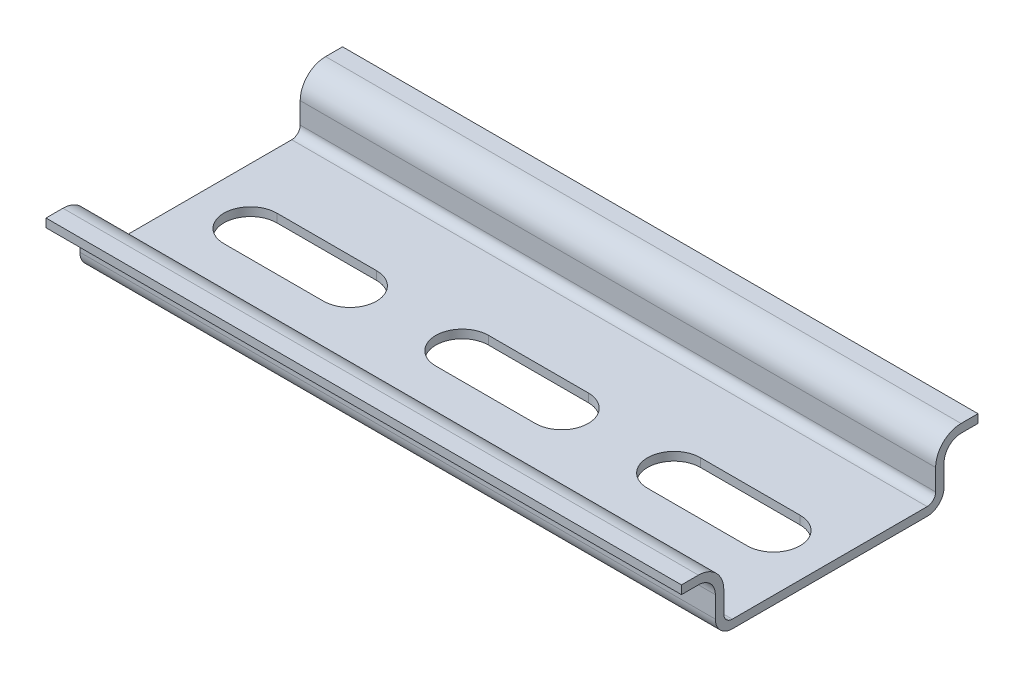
ISO-10303-21;
HEADER;
FILE_DESCRIPTION(('STEP AP214'),'2;1');
FILE_NAME('part.step','',(''),(''),'','','');
FILE_SCHEMA(('AUTOMOTIVE_DESIGN { 1 0 10303 214 1 1 1 1 }'));
ENDSEC;
DATA;
#1=APPLICATION_CONTEXT('core data for automotive mechanical design processes');
#2=APPLICATION_PROTOCOL_DEFINITION('international standard','automotive_design',2000,#1);
#3=PRODUCT_CONTEXT('',#1,'mechanical');
#4=PRODUCT('Part','Part','',(#3));
#5=PRODUCT_RELATED_PRODUCT_CATEGORY('part','',(#4));
#6=PRODUCT_DEFINITION_FORMATION('','',#4);
#7=PRODUCT_DEFINITION_CONTEXT('part definition',#1,'design');
#8=PRODUCT_DEFINITION('design','',#6,#7);
#9=PRODUCT_DEFINITION_SHAPE('','',#8);
#10=(LENGTH_UNIT() NAMED_UNIT(*) SI_UNIT(.MILLI.,.METRE.));
#11=(NAMED_UNIT(*) PLANE_ANGLE_UNIT() SI_UNIT($,.RADIAN.));
#12=(NAMED_UNIT(*) SI_UNIT($,.STERADIAN.) SOLID_ANGLE_UNIT());
#13=UNCERTAINTY_MEASURE_WITH_UNIT(LENGTH_MEASURE(1.E-05),#10,'distance_accuracy_value','');
#14=(GEOMETRIC_REPRESENTATION_CONTEXT(3) GLOBAL_UNCERTAINTY_ASSIGNED_CONTEXT((#13)) GLOBAL_UNIT_ASSIGNED_CONTEXT((#10,
#11,#12)) REPRESENTATION_CONTEXT('',''));
#15=CARTESIAN_POINT('',(0.,0.,0.));
#16=DIRECTION('',(0.,0.,1.));
#17=DIRECTION('',(1.,0.,0.));
#18=AXIS2_PLACEMENT_3D('',#15,#16,#17);
#19=CARTESIAN_POINT('',(-37.5,7.5,15.5));
#20=DIRECTION('',(0.,1.,0.));
#21=DIRECTION('',(0.,0.,1.));
#22=AXIS2_PLACEMENT_3D('',#19,#20,#21);
#23=PLANE('',#22);
#24=DIRECTION('',(1.,0.,0.));
#25=VECTOR('',#24,1.);
#26=CARTESIAN_POINT('',(-37.5,7.5,17.5));
#27=LINE('',#26,#25);
#28=CARTESIAN_POINT('',(-37.5,7.5,17.5));
#29=VERTEX_POINT('',#28);
#30=CARTESIAN_POINT('',(37.5,7.5,17.5));
#31=VERTEX_POINT('',#30);
#32=EDGE_CURVE('E34',#29,#31,#27,.T.);
#33=ORIENTED_EDGE('',*,*,#32,.T.);
#34=DIRECTION('',(0.,0.,-1.));
#35=VECTOR('',#34,1.);
#36=CARTESIAN_POINT('',(37.5,7.5,15.5));
#37=LINE('',#36,#35);
#38=CARTESIAN_POINT('',(37.5,7.5,15.5));
#39=VERTEX_POINT('',#38);
#40=EDGE_CURVE('E338',#39,#31,#37,.F.);
#41=ORIENTED_EDGE('',*,*,#40,.F.);
#42=DIRECTION('',(1.,0.,0.));
#43=VECTOR('',#42,1.);
#44=CARTESIAN_POINT('',(-37.5,7.5,15.5));
#45=LINE('',#44,#43);
#46=CARTESIAN_POINT('',(-37.5,7.5,15.5));
#47=VERTEX_POINT('',#46);
#48=EDGE_CURVE('E11',#47,#39,#45,.T.);
#49=ORIENTED_EDGE('',*,*,#48,.F.);
#50=DIRECTION('',(0.,0.,-1.));
#51=VECTOR('',#50,1.);
#52=CARTESIAN_POINT('',(-37.5,7.5,15.5));
#53=LINE('',#52,#51);
#54=EDGE_CURVE('E398',#47,#29,#53,.F.);
#55=ORIENTED_EDGE('',*,*,#54,.T.);
#56=EDGE_LOOP('',(#33,#41,#49,#55));
#57=FACE_BOUND('',#56,.T.);
#58=ADVANCED_FACE('F31',(#57),#23,.T.);
#59=CARTESIAN_POINT('',(-37.5,4.5,15.5));
#60=DIRECTION('',(1.,0.,0.));
#61=DIRECTION('',(0.,0.,-1.));
#62=AXIS2_PLACEMENT_3D('',#59,#60,#61);
#63=CYLINDRICAL_SURFACE('',#62,3.);
#64=ORIENTED_EDGE('',*,*,#48,.T.);
#65=CARTESIAN_POINT('',(37.5,4.5,15.5));
#66=DIRECTION('',(1.,0.,0.));
#67=DIRECTION('',(0.,0.,-1.));
#68=AXIS2_PLACEMENT_3D('',#65,#66,#67);
#69=CIRCLE('',#68,3.);
#70=CARTESIAN_POINT('',(37.5,4.5,12.5));
#71=VERTEX_POINT('',#70);
#72=EDGE_CURVE('E395',#71,#39,#69,.T.);
#73=ORIENTED_EDGE('',*,*,#72,.F.);
#74=DIRECTION('',(1.,0.,0.));
#75=VECTOR('',#74,1.);
#76=CARTESIAN_POINT('',(-37.5,4.5,12.5));
#77=LINE('',#76,#75);
#78=CARTESIAN_POINT('',(-37.5,4.5,12.5));
#79=VERTEX_POINT('',#78);
#80=EDGE_CURVE('E39',#79,#71,#77,.T.);
#81=ORIENTED_EDGE('',*,*,#80,.F.);
#82=CARTESIAN_POINT('',(-37.5,4.5,15.5));
#83=DIRECTION('',(1.,0.,0.));
#84=DIRECTION('',(0.,0.,-1.));
#85=AXIS2_PLACEMENT_3D('',#82,#83,#84);
#86=CIRCLE('',#85,3.);
#87=EDGE_CURVE('E444',#79,#47,#86,.T.);
#88=ORIENTED_EDGE('',*,*,#87,.T.);
#89=EDGE_LOOP('',(#64,#73,#81,#88));
#90=FACE_BOUND('',#89,.T.);
#91=ADVANCED_FACE('F506',(#90),#63,.T.);
#92=CARTESIAN_POINT('',(-37.5,2.,12.5));
#93=DIRECTION('',(0.,0.,-1.));
#94=DIRECTION('',(-1.,0.,0.));
#95=AXIS2_PLACEMENT_3D('',#92,#93,#94);
#96=PLANE('',#95);
#97=ORIENTED_EDGE('',*,*,#80,.T.);
#98=DIRECTION('',(0.,1.,0.));
#99=VECTOR('',#98,1.);
#100=CARTESIAN_POINT('',(37.5,2.,12.5));
#101=LINE('',#100,#99);
#102=CARTESIAN_POINT('',(37.5,2.,12.5));
#103=VERTEX_POINT('',#102);
#104=EDGE_CURVE('E392',#103,#71,#101,.T.);
#105=ORIENTED_EDGE('',*,*,#104,.F.);
#106=DIRECTION('',(1.,0.,0.));
#107=VECTOR('',#106,1.);
#108=CARTESIAN_POINT('',(-37.5,2.,12.5));
#109=LINE('',#108,#107);
#110=CARTESIAN_POINT('',(-37.5,2.,12.5));
#111=VERTEX_POINT('',#110);
#112=EDGE_CURVE('E448',#111,#103,#109,.T.);
#113=ORIENTED_EDGE('',*,*,#112,.F.);
#114=DIRECTION('',(0.,1.,0.));
#115=VECTOR('',#114,1.);
#116=CARTESIAN_POINT('',(-37.5,2.,12.5));
#117=LINE('',#116,#115);
#118=EDGE_CURVE('E441',#111,#79,#117,.T.);
#119=ORIENTED_EDGE('',*,*,#118,.T.);
#120=EDGE_LOOP('',(#97,#105,#113,#119));
#121=FACE_BOUND('',#120,.T.);
#122=ADVANCED_FACE('F510',(#121),#96,.T.);
#123=CARTESIAN_POINT('',(-37.5,2.,11.5));
#124=DIRECTION('',(1.,0.,0.));
#125=DIRECTION('',(0.,0.,-1.));
#126=AXIS2_PLACEMENT_3D('',#123,#124,#125);
#127=CYLINDRICAL_SURFACE('',#126,0.999999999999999);
#128=ORIENTED_EDGE('',*,*,#112,.T.);
#129=CARTESIAN_POINT('',(37.5,2.,11.5));
#130=DIRECTION('',(1.,0.,0.));
#131=DIRECTION('',(0.,0.,-1.));
#132=AXIS2_PLACEMENT_3D('',#129,#130,#131);
#133=CIRCLE('',#132,0.999999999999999);
#134=CARTESIAN_POINT('',(37.5,1.,11.5));
#135=VERTEX_POINT('',#134);
#136=EDGE_CURVE('E389',#135,#103,#133,.F.);
#137=ORIENTED_EDGE('',*,*,#136,.F.);
#138=DIRECTION('',(1.,0.,0.));
#139=VECTOR('',#138,1.);
#140=CARTESIAN_POINT('',(-37.5,1.,11.5));
#141=LINE('',#140,#139);
#142=CARTESIAN_POINT('',(-37.5,1.,11.5));
#143=VERTEX_POINT('',#142);
#144=EDGE_CURVE('E450',#143,#135,#141,.T.);
#145=ORIENTED_EDGE('',*,*,#144,.F.);
#146=CARTESIAN_POINT('',(-37.5,2.,11.5));
#147=DIRECTION('',(1.,0.,0.));
#148=DIRECTION('',(0.,0.,-1.));
#149=AXIS2_PLACEMENT_3D('',#146,#147,#148);
#150=CIRCLE('',#149,0.999999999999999);
#151=EDGE_CURVE('E438',#143,#111,#150,.F.);
#152=ORIENTED_EDGE('',*,*,#151,.T.);
#153=EDGE_LOOP('',(#128,#137,#145,#152));
#154=FACE_BOUND('',#153,.T.);
#155=ADVANCED_FACE('F516',(#154),#127,.F.);
#156=CARTESIAN_POINT('',(-37.5,1.,11.5));
#157=DIRECTION('',(0.,1.,0.));
#158=DIRECTION('',(0.,0.,1.));
#159=AXIS2_PLACEMENT_3D('',#156,#157,#158);
#160=PLANE('',#159);
#161=CARTESIAN_POINT('',(30.875,0.999999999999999,0.));
#162=DIRECTION('',(0.,1.,0.));
#163=DIRECTION('',(0.,0.,1.));
#164=AXIS2_PLACEMENT_3D('',#161,#162,#163);
#165=CIRCLE('',#164,3.125);
#166=CARTESIAN_POINT('',(30.875,0.999999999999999,-3.125));
#167=VERTEX_POINT('',#166);
#168=CARTESIAN_POINT('',(30.875,0.999999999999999,3.125));
#169=VERTEX_POINT('',#168);
#170=EDGE_CURVE('E250',#167,#169,#165,.F.);
#171=ORIENTED_EDGE('',*,*,#170,.T.);
#172=DIRECTION('',(-1.,0.,0.));
#173=VECTOR('',#172,1.);
#174=CARTESIAN_POINT('',(19.125,0.999999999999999,3.125));
#175=LINE('',#174,#173);
#176=CARTESIAN_POINT('',(19.125,1.,3.125));
#177=VERTEX_POINT('',#176);
#178=EDGE_CURVE('E239',#169,#177,#175,.T.);
#179=ORIENTED_EDGE('',*,*,#178,.T.);
#180=CARTESIAN_POINT('',(19.125,0.999999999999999,0.));
#181=DIRECTION('',(0.,1.,0.));
#182=DIRECTION('',(0.,0.,1.));
#183=AXIS2_PLACEMENT_3D('',#180,#181,#182);
#184=CIRCLE('',#183,3.125);
#185=CARTESIAN_POINT('',(19.125,0.999999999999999,-3.125));
#186=VERTEX_POINT('',#185);
#187=EDGE_CURVE('E261',#177,#186,#184,.F.);
#188=ORIENTED_EDGE('',*,*,#187,.T.);
#189=DIRECTION('',(1.,0.,0.));
#190=VECTOR('',#189,1.);
#191=CARTESIAN_POINT('',(19.125,0.999999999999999,-3.125));
#192=LINE('',#191,#190);
#193=EDGE_CURVE('E257',#186,#167,#192,.T.);
#194=ORIENTED_EDGE('',*,*,#193,.T.);
#195=EDGE_LOOP('',(#171,#179,#188,#194));
#196=FACE_BOUND('',#195,.T.);
#197=CARTESIAN_POINT('',(-19.125,0.999999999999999,0.));
#198=DIRECTION('',(0.,1.,0.));
#199=DIRECTION('',(0.,0.,1.));
#200=AXIS2_PLACEMENT_3D('',#197,#198,#199);
#201=CIRCLE('',#200,3.125);
#202=CARTESIAN_POINT('',(-19.125,0.999999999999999,-3.125));
#203=VERTEX_POINT('',#202);
#204=CARTESIAN_POINT('',(-19.125,0.999999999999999,3.125));
#205=VERTEX_POINT('',#204);
#206=EDGE_CURVE('E280',#203,#205,#201,.F.);
#207=ORIENTED_EDGE('',*,*,#206,.T.);
#208=DIRECTION('',(-1.,0.,0.));
#209=VECTOR('',#208,1.);
#210=CARTESIAN_POINT('',(-30.875,0.999999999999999,3.125));
#211=LINE('',#210,#209);
#212=CARTESIAN_POINT('',(-30.875,1.,3.125));
#213=VERTEX_POINT('',#212);
#214=EDGE_CURVE('E297',#205,#213,#211,.T.);
#215=ORIENTED_EDGE('',*,*,#214,.T.);
#216=CARTESIAN_POINT('',(-30.875,0.999999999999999,0.));
#217=DIRECTION('',(0.,1.,0.));
#218=DIRECTION('',(0.,0.,1.));
#219=AXIS2_PLACEMENT_3D('',#216,#217,#218);
#220=CIRCLE('',#219,3.125);
#221=CARTESIAN_POINT('',(-30.875,0.999999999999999,-3.125));
#222=VERTEX_POINT('',#221);
#223=EDGE_CURVE('E246',#213,#222,#220,.F.);
#224=ORIENTED_EDGE('',*,*,#223,.T.);
#225=DIRECTION('',(1.,0.,0.));
#226=VECTOR('',#225,1.);
#227=CARTESIAN_POINT('',(-30.875,0.999999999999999,-3.125));
#228=LINE('',#227,#226);
#229=EDGE_CURVE('E277',#222,#203,#228,.T.);
#230=ORIENTED_EDGE('',*,*,#229,.T.);
#231=EDGE_LOOP('',(#207,#215,#224,#230));
#232=FACE_BOUND('',#231,.T.);
#233=CARTESIAN_POINT('',(5.875,0.999999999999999,0.));
#234=DIRECTION('',(0.,1.,0.));
#235=DIRECTION('',(0.,0.,1.));
#236=AXIS2_PLACEMENT_3D('',#233,#234,#235);
#237=CIRCLE('',#236,3.125);
#238=CARTESIAN_POINT('',(5.875,0.999999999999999,-3.125));
#239=VERTEX_POINT('',#238);
#240=CARTESIAN_POINT('',(5.875,0.999999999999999,3.125));
#241=VERTEX_POINT('',#240);
#242=EDGE_CURVE('E312',#239,#241,#237,.F.);
#243=ORIENTED_EDGE('',*,*,#242,.T.);
#244=DIRECTION('',(-1.,0.,0.));
#245=VECTOR('',#244,1.);
#246=CARTESIAN_POINT('',(-5.875,0.999999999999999,3.125));
#247=LINE('',#246,#245);
#248=CARTESIAN_POINT('',(-5.875,1.,3.125));
#249=VERTEX_POINT('',#248);
#250=EDGE_CURVE('E329',#241,#249,#247,.T.);
#251=ORIENTED_EDGE('',*,*,#250,.T.);
#252=CARTESIAN_POINT('',(-5.875,0.999999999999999,0.));
#253=DIRECTION('',(0.,1.,0.));
#254=DIRECTION('',(0.,0.,1.));
#255=AXIS2_PLACEMENT_3D('',#252,#253,#254);
#256=CIRCLE('',#255,3.125);
#257=CARTESIAN_POINT('',(-5.875,0.999999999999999,-3.125));
#258=VERTEX_POINT('',#257);
#259=EDGE_CURVE('E306',#249,#258,#256,.F.);
#260=ORIENTED_EDGE('',*,*,#259,.T.);
#261=DIRECTION('',(1.,0.,0.));
#262=VECTOR('',#261,1.);
#263=CARTESIAN_POINT('',(-5.875,0.999999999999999,-3.125));
#264=LINE('',#263,#262);
#265=EDGE_CURVE('E309',#258,#239,#264,.T.);
#266=ORIENTED_EDGE('',*,*,#265,.T.);
#267=EDGE_LOOP('',(#243,#251,#260,#266));
#268=FACE_BOUND('',#267,.T.);
#269=ORIENTED_EDGE('',*,*,#144,.T.);
#270=DIRECTION('',(0.,0.,-1.));
#271=VECTOR('',#270,1.);
#272=CARTESIAN_POINT('',(37.5,1.,11.5));
#273=LINE('',#272,#271);
#274=CARTESIAN_POINT('',(37.5,1.,-11.5));
#275=VERTEX_POINT('',#274);
#276=EDGE_CURVE('E386',#275,#135,#273,.F.);
#277=ORIENTED_EDGE('',*,*,#276,.F.);
#278=DIRECTION('',(1.,0.,0.));
#279=VECTOR('',#278,1.);
#280=CARTESIAN_POINT('',(-37.5,1.,-11.5));
#281=LINE('',#280,#279);
#282=CARTESIAN_POINT('',(-37.5,1.,-11.5));
#283=VERTEX_POINT('',#282);
#284=EDGE_CURVE('E452',#283,#275,#281,.T.);
#285=ORIENTED_EDGE('',*,*,#284,.F.);
#286=DIRECTION('',(0.,0.,-1.));
#287=VECTOR('',#286,1.);
#288=CARTESIAN_POINT('',(-37.5,1.,11.5));
#289=LINE('',#288,#287);
#290=EDGE_CURVE('E435',#283,#143,#289,.F.);
#291=ORIENTED_EDGE('',*,*,#290,.T.);
#292=EDGE_LOOP('',(#269,#277,#285,#291));
#293=FACE_BOUND('',#292,.T.);
#294=ADVANCED_FACE('F255',(#196,#232,#268,#293),#160,.T.);
#295=CARTESIAN_POINT('',(-37.5,2.,-11.5));
#296=DIRECTION('',(1.,0.,0.));
#297=DIRECTION('',(0.,0.,-1.));
#298=AXIS2_PLACEMENT_3D('',#295,#296,#297);
#299=CYLINDRICAL_SURFACE('',#298,0.999999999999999);
#300=ORIENTED_EDGE('',*,*,#284,.T.);
#301=CARTESIAN_POINT('',(37.5,2.,-11.5));
#302=DIRECTION('',(1.,0.,0.));
#303=DIRECTION('',(0.,0.,-1.));
#304=AXIS2_PLACEMENT_3D('',#301,#302,#303);
#305=CIRCLE('',#304,0.999999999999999);
#306=CARTESIAN_POINT('',(37.5,2.,-12.5));
#307=VERTEX_POINT('',#306);
#308=EDGE_CURVE('E383',#307,#275,#305,.F.);
#309=ORIENTED_EDGE('',*,*,#308,.F.);
#310=DIRECTION('',(1.,0.,0.));
#311=VECTOR('',#310,1.);
#312=CARTESIAN_POINT('',(-37.5,2.,-12.5));
#313=LINE('',#312,#311);
#314=CARTESIAN_POINT('',(-37.5,2.,-12.5));
#315=VERTEX_POINT('',#314);
#316=EDGE_CURVE('E454',#315,#307,#313,.T.);
#317=ORIENTED_EDGE('',*,*,#316,.F.);
#318=CARTESIAN_POINT('',(-37.5,2.,-11.5));
#319=DIRECTION('',(1.,0.,0.));
#320=DIRECTION('',(0.,0.,-1.));
#321=AXIS2_PLACEMENT_3D('',#318,#319,#320);
#322=CIRCLE('',#321,0.999999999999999);
#323=EDGE_CURVE('E432',#315,#283,#322,.F.);
#324=ORIENTED_EDGE('',*,*,#323,.T.);
#325=EDGE_LOOP('',(#300,#309,#317,#324));
#326=FACE_BOUND('',#325,.T.);
#327=ADVANCED_FACE('F526',(#326),#299,.F.);
#328=CARTESIAN_POINT('',(-37.5,2.,-12.5));
#329=DIRECTION('',(0.,0.,1.));
#330=DIRECTION('',(1.,0.,0.));
#331=AXIS2_PLACEMENT_3D('',#328,#329,#330);
#332=PLANE('',#331);
#333=ORIENTED_EDGE('',*,*,#316,.T.);
#334=DIRECTION('',(0.,1.,0.));
#335=VECTOR('',#334,1.);
#336=CARTESIAN_POINT('',(37.5,2.,-12.5));
#337=LINE('',#336,#335);
#338=CARTESIAN_POINT('',(37.5,4.5,-12.5));
#339=VERTEX_POINT('',#338);
#340=EDGE_CURVE('E380',#339,#307,#337,.F.);
#341=ORIENTED_EDGE('',*,*,#340,.F.);
#342=DIRECTION('',(1.,0.,0.));
#343=VECTOR('',#342,1.);
#344=CARTESIAN_POINT('',(-37.5,4.5,-12.5));
#345=LINE('',#344,#343);
#346=CARTESIAN_POINT('',(-37.5,4.5,-12.5));
#347=VERTEX_POINT('',#346);
#348=EDGE_CURVE('E456',#347,#339,#345,.T.);
#349=ORIENTED_EDGE('',*,*,#348,.F.);
#350=DIRECTION('',(0.,1.,0.));
#351=VECTOR('',#350,1.);
#352=CARTESIAN_POINT('',(-37.5,2.,-12.5));
#353=LINE('',#352,#351);
#354=EDGE_CURVE('E429',#347,#315,#353,.F.);
#355=ORIENTED_EDGE('',*,*,#354,.T.);
#356=EDGE_LOOP('',(#333,#341,#349,#355));
#357=FACE_BOUND('',#356,.T.);
#358=ADVANCED_FACE('F529',(#357),#332,.T.);
#359=CARTESIAN_POINT('',(-37.5,4.5,-15.5));
#360=DIRECTION('',(1.,0.,0.));
#361=DIRECTION('',(0.,0.,-1.));
#362=AXIS2_PLACEMENT_3D('',#359,#360,#361);
#363=CYLINDRICAL_SURFACE('',#362,3.);
#364=ORIENTED_EDGE('',*,*,#348,.T.);
#365=CARTESIAN_POINT('',(37.5,4.5,-15.5));
#366=DIRECTION('',(1.,0.,0.));
#367=DIRECTION('',(0.,0.,-1.));
#368=AXIS2_PLACEMENT_3D('',#365,#366,#367);
#369=CIRCLE('',#368,3.);
#370=CARTESIAN_POINT('',(37.5,7.5,-15.5));
#371=VERTEX_POINT('',#370);
#372=EDGE_CURVE('E377',#371,#339,#369,.T.);
#373=ORIENTED_EDGE('',*,*,#372,.F.);
#374=DIRECTION('',(1.,0.,0.));
#375=VECTOR('',#374,1.);
#376=CARTESIAN_POINT('',(-37.5,7.5,-15.5));
#377=LINE('',#376,#375);
#378=CARTESIAN_POINT('',(-37.5,7.5,-15.5));
#379=VERTEX_POINT('',#378);
#380=EDGE_CURVE('E458',#379,#371,#377,.T.);
#381=ORIENTED_EDGE('',*,*,#380,.F.);
#382=CARTESIAN_POINT('',(-37.5,4.5,-15.5));
#383=DIRECTION('',(1.,0.,0.));
#384=DIRECTION('',(0.,0.,-1.));
#385=AXIS2_PLACEMENT_3D('',#382,#383,#384);
#386=CIRCLE('',#385,3.);
#387=EDGE_CURVE('E426',#379,#347,#386,.T.);
#388=ORIENTED_EDGE('',*,*,#387,.T.);
#389=EDGE_LOOP('',(#364,#373,#381,#388));
#390=FACE_BOUND('',#389,.T.);
#391=ADVANCED_FACE('F533',(#390),#363,.T.);
#392=CARTESIAN_POINT('',(-37.5,7.5,-15.5));
#393=DIRECTION('',(0.,1.,0.));
#394=DIRECTION('',(0.,0.,1.));
#395=AXIS2_PLACEMENT_3D('',#392,#393,#394);
#396=PLANE('',#395);
#397=ORIENTED_EDGE('',*,*,#380,.T.);
#398=DIRECTION('',(0.,0.,-1.));
#399=VECTOR('',#398,1.);
#400=CARTESIAN_POINT('',(37.5,7.5,-15.5));
#401=LINE('',#400,#399);
#402=CARTESIAN_POINT('',(37.5,7.5,-17.5));
#403=VERTEX_POINT('',#402);
#404=EDGE_CURVE('E374',#403,#371,#401,.F.);
#405=ORIENTED_EDGE('',*,*,#404,.F.);
#406=DIRECTION('',(1.,0.,0.));
#407=VECTOR('',#406,1.);
#408=CARTESIAN_POINT('',(-37.5,7.5,-17.5));
#409=LINE('',#408,#407);
#410=CARTESIAN_POINT('',(-37.5,7.5,-17.5));
#411=VERTEX_POINT('',#410);
#412=EDGE_CURVE('E460',#411,#403,#409,.T.);
#413=ORIENTED_EDGE('',*,*,#412,.F.);
#414=DIRECTION('',(0.,0.,-1.));
#415=VECTOR('',#414,1.);
#416=CARTESIAN_POINT('',(-37.5,7.5,-15.5));
#417=LINE('',#416,#415);
#418=EDGE_CURVE('E423',#411,#379,#417,.F.);
#419=ORIENTED_EDGE('',*,*,#418,.T.);
#420=EDGE_LOOP('',(#397,#405,#413,#419));
#421=FACE_BOUND('',#420,.T.);
#422=ADVANCED_FACE('F537',(#421),#396,.T.);
#423=CARTESIAN_POINT('',(-37.5,7.5,-17.5));
#424=DIRECTION('',(0.,0.,1.));
#425=DIRECTION('',(1.,0.,0.));
#426=AXIS2_PLACEMENT_3D('',#423,#424,#425);
#427=PLANE('',#426);
#428=ORIENTED_EDGE('',*,*,#412,.T.);
#429=DIRECTION('',(0.,-1.,0.));
#430=VECTOR('',#429,1.);
#431=CARTESIAN_POINT('',(37.5,7.5,-17.5));
#432=LINE('',#431,#430);
#433=CARTESIAN_POINT('',(37.5,6.5,-17.5));
#434=VERTEX_POINT('',#433);
#435=EDGE_CURVE('E371',#403,#434,#432,.T.);
#436=ORIENTED_EDGE('',*,*,#435,.T.);
#437=DIRECTION('',(1.,0.,0.));
#438=VECTOR('',#437,1.);
#439=CARTESIAN_POINT('',(-37.5,6.5,-17.5));
#440=LINE('',#439,#438);
#441=CARTESIAN_POINT('',(-37.5,6.5,-17.5));
#442=VERTEX_POINT('',#441);
#443=EDGE_CURVE('E462',#442,#434,#440,.T.);
#444=ORIENTED_EDGE('',*,*,#443,.F.);
#445=DIRECTION('',(0.,-1.,0.));
#446=VECTOR('',#445,1.);
#447=CARTESIAN_POINT('',(-37.5,7.5,-17.5));
#448=LINE('',#447,#446);
#449=EDGE_CURVE('E421',#411,#442,#448,.T.);
#450=ORIENTED_EDGE('',*,*,#449,.F.);
#451=EDGE_LOOP('',(#428,#436,#444,#450));
#452=FACE_BOUND('',#451,.T.);
#453=ADVANCED_FACE('F541',(#452),#427,.F.);
#454=CARTESIAN_POINT('',(-37.5,6.5,-15.5));
#455=DIRECTION('',(0.,1.,0.));
#456=DIRECTION('',(0.,0.,1.));
#457=AXIS2_PLACEMENT_3D('',#454,#455,#456);
#458=PLANE('',#457);
#459=ORIENTED_EDGE('',*,*,#443,.T.);
#460=DIRECTION('',(0.,0.,1.));
#461=VECTOR('',#460,1.);
#462=CARTESIAN_POINT('',(37.5,6.5,-15.5));
#463=LINE('',#462,#461);
#464=CARTESIAN_POINT('',(37.5,6.5,-15.5));
#465=VERTEX_POINT('',#464);
#466=EDGE_CURVE('E368',#434,#465,#463,.T.);
#467=ORIENTED_EDGE('',*,*,#466,.T.);
#468=DIRECTION('',(1.,0.,0.));
#469=VECTOR('',#468,1.);
#470=CARTESIAN_POINT('',(-37.5,6.5,-15.5));
#471=LINE('',#470,#469);
#472=CARTESIAN_POINT('',(-37.5,6.5,-15.5));
#473=VERTEX_POINT('',#472);
#474=EDGE_CURVE('E464',#473,#465,#471,.T.);
#475=ORIENTED_EDGE('',*,*,#474,.F.);
#476=DIRECTION('',(0.,0.,1.));
#477=VECTOR('',#476,1.);
#478=CARTESIAN_POINT('',(-37.5,6.5,-15.5));
#479=LINE('',#478,#477);
#480=EDGE_CURVE('E419',#442,#473,#479,.T.);
#481=ORIENTED_EDGE('',*,*,#480,.F.);
#482=EDGE_LOOP('',(#459,#467,#475,#481));
#483=FACE_BOUND('',#482,.T.);
#484=ADVANCED_FACE('F545',(#483),#458,.F.);
#485=CARTESIAN_POINT('',(-37.5,4.5,-15.5));
#486=DIRECTION('',(1.,0.,0.));
#487=DIRECTION('',(0.,0.,-1.));
#488=AXIS2_PLACEMENT_3D('',#485,#486,#487);
#489=CYLINDRICAL_SURFACE('',#488,2.);
#490=ORIENTED_EDGE('',*,*,#474,.T.);
#491=CARTESIAN_POINT('',(37.5,4.5,-15.5));
#492=DIRECTION('',(1.,0.,0.));
#493=DIRECTION('',(0.,0.,-1.));
#494=AXIS2_PLACEMENT_3D('',#491,#492,#493);
#495=CIRCLE('',#494,2.);
#496=CARTESIAN_POINT('',(37.5,4.5,-13.5));
#497=VERTEX_POINT('',#496);
#498=EDGE_CURVE('E365',#465,#497,#495,.T.);
#499=ORIENTED_EDGE('',*,*,#498,.T.);
#500=DIRECTION('',(1.,0.,0.));
#501=VECTOR('',#500,1.);
#502=CARTESIAN_POINT('',(-37.5,4.5,-13.5));
#503=LINE('',#502,#501);
#504=CARTESIAN_POINT('',(-37.5,4.5,-13.5));
#505=VERTEX_POINT('',#504);
#506=EDGE_CURVE('E466',#505,#497,#503,.T.);
#507=ORIENTED_EDGE('',*,*,#506,.F.);
#508=CARTESIAN_POINT('',(-37.5,4.5,-15.5));
#509=DIRECTION('',(1.,0.,0.));
#510=DIRECTION('',(0.,0.,-1.));
#511=AXIS2_PLACEMENT_3D('',#508,#509,#510);
#512=CIRCLE('',#511,2.);
#513=EDGE_CURVE('E417',#473,#505,#512,.T.);
#514=ORIENTED_EDGE('',*,*,#513,.F.);
#515=EDGE_LOOP('',(#490,#499,#507,#514));
#516=FACE_BOUND('',#515,.T.);
#517=ADVANCED_FACE('F549',(#516),#489,.F.);
#518=CARTESIAN_POINT('',(-37.5,2.,-13.5));
#519=DIRECTION('',(0.,0.,1.));
#520=DIRECTION('',(1.,0.,0.));
#521=AXIS2_PLACEMENT_3D('',#518,#519,#520);
#522=PLANE('',#521);
#523=ORIENTED_EDGE('',*,*,#506,.T.);
#524=DIRECTION('',(0.,-1.,0.));
#525=VECTOR('',#524,1.);
#526=CARTESIAN_POINT('',(37.5,2.,-13.5));
#527=LINE('',#526,#525);
#528=CARTESIAN_POINT('',(37.5,2.,-13.5));
#529=VERTEX_POINT('',#528);
#530=EDGE_CURVE('E362',#497,#529,#527,.T.);
#531=ORIENTED_EDGE('',*,*,#530,.T.);
#532=DIRECTION('',(1.,0.,0.));
#533=VECTOR('',#532,1.);
#534=CARTESIAN_POINT('',(-37.5,2.,-13.5));
#535=LINE('',#534,#533);
#536=CARTESIAN_POINT('',(-37.5,2.,-13.5));
#537=VERTEX_POINT('',#536);
#538=EDGE_CURVE('E468',#537,#529,#535,.T.);
#539=ORIENTED_EDGE('',*,*,#538,.F.);
#540=DIRECTION('',(0.,-1.,0.));
#541=VECTOR('',#540,1.);
#542=CARTESIAN_POINT('',(-37.5,2.,-13.5));
#543=LINE('',#542,#541);
#544=EDGE_CURVE('E415',#505,#537,#543,.T.);
#545=ORIENTED_EDGE('',*,*,#544,.F.);
#546=EDGE_LOOP('',(#523,#531,#539,#545));
#547=FACE_BOUND('',#546,.T.);
#548=ADVANCED_FACE('F553',(#547),#522,.F.);
#549=CARTESIAN_POINT('',(-37.5,2.,-11.5));
#550=DIRECTION('',(1.,0.,0.));
#551=DIRECTION('',(0.,0.,-1.));
#552=AXIS2_PLACEMENT_3D('',#549,#550,#551);
#553=CYLINDRICAL_SURFACE('',#552,2.);
#554=ORIENTED_EDGE('',*,*,#538,.T.);
#555=CARTESIAN_POINT('',(37.5,2.,-11.5));
#556=DIRECTION('',(-1.,0.,0.));
#557=DIRECTION('',(0.,0.,1.));
#558=AXIS2_PLACEMENT_3D('',#555,#556,#557);
#559=CIRCLE('',#558,2.);
#560=CARTESIAN_POINT('',(37.5,0.,-11.5));
#561=VERTEX_POINT('',#560);
#562=EDGE_CURVE('E359',#529,#561,#559,.T.);
#563=ORIENTED_EDGE('',*,*,#562,.T.);
#564=DIRECTION('',(1.,0.,0.));
#565=VECTOR('',#564,1.);
#566=CARTESIAN_POINT('',(-37.5,0.,-11.5));
#567=LINE('',#566,#565);
#568=CARTESIAN_POINT('',(-37.5,0.,-11.5));
#569=VERTEX_POINT('',#568);
#570=EDGE_CURVE('E470',#569,#561,#567,.T.);
#571=ORIENTED_EDGE('',*,*,#570,.F.);
#572=CARTESIAN_POINT('',(-37.5,2.,-11.5));
#573=DIRECTION('',(-1.,0.,0.));
#574=DIRECTION('',(0.,0.,1.));
#575=AXIS2_PLACEMENT_3D('',#572,#573,#574);
#576=CIRCLE('',#575,2.);
#577=EDGE_CURVE('E413',#537,#569,#576,.T.);
#578=ORIENTED_EDGE('',*,*,#577,.F.);
#579=EDGE_LOOP('',(#554,#563,#571,#578));
#580=FACE_BOUND('',#579,.T.);
#581=ADVANCED_FACE('F557',(#580),#553,.T.);
#582=CARTESIAN_POINT('',(-37.5,0.,11.5));
#583=DIRECTION('',(0.,1.,0.));
#584=DIRECTION('',(0.,0.,1.));
#585=AXIS2_PLACEMENT_3D('',#582,#583,#584);
#586=PLANE('',#585);
#587=DIRECTION('',(-1.,0.,0.));
#588=VECTOR('',#587,1.);
#589=CARTESIAN_POINT('',(19.125,0.,3.125));
#590=LINE('',#589,#588);
#591=CARTESIAN_POINT('',(30.875,0.,3.125));
#592=VERTEX_POINT('',#591);
#593=CARTESIAN_POINT('',(19.125,0.,3.125));
#594=VERTEX_POINT('',#593);
#595=EDGE_CURVE('E259',#592,#594,#590,.T.);
#596=ORIENTED_EDGE('',*,*,#595,.F.);
#597=CARTESIAN_POINT('',(30.875,0.,0.));
#598=DIRECTION('',(0.,-1.,0.));
#599=DIRECTION('',(0.,0.,1.));
#600=AXIS2_PLACEMENT_3D('',#597,#598,#599);
#601=CIRCLE('',#600,3.125);
#602=CARTESIAN_POINT('',(30.875,0.,-3.125));
#603=VERTEX_POINT('',#602);
#604=EDGE_CURVE('E55',#603,#592,#601,.T.);
#605=ORIENTED_EDGE('',*,*,#604,.F.);
#606=DIRECTION('',(1.,0.,0.));
#607=VECTOR('',#606,1.);
#608=CARTESIAN_POINT('',(19.125,0.,-3.125));
#609=LINE('',#608,#607);
#610=CARTESIAN_POINT('',(19.125,0.,-3.125));
#611=VERTEX_POINT('',#610);
#612=EDGE_CURVE('E252',#611,#603,#609,.T.);
#613=ORIENTED_EDGE('',*,*,#612,.F.);
#614=CARTESIAN_POINT('',(19.125,0.,0.));
#615=DIRECTION('',(0.,-1.,0.));
#616=DIRECTION('',(0.,0.,-1.));
#617=AXIS2_PLACEMENT_3D('',#614,#615,#616);
#618=CIRCLE('',#617,3.125);
#619=EDGE_CURVE('E266',#594,#611,#618,.T.);
#620=ORIENTED_EDGE('',*,*,#619,.F.);
#621=EDGE_LOOP('',(#596,#605,#613,#620));
#622=FACE_BOUND('',#621,.T.);
#623=DIRECTION('',(-1.,0.,0.));
#624=VECTOR('',#623,1.);
#625=CARTESIAN_POINT('',(-30.875,0.,3.125));
#626=LINE('',#625,#624);
#627=CARTESIAN_POINT('',(-19.125,0.,3.125));
#628=VERTEX_POINT('',#627);
#629=CARTESIAN_POINT('',(-30.875,0.,3.125));
#630=VERTEX_POINT('',#629);
#631=EDGE_CURVE('E285',#628,#630,#626,.T.);
#632=ORIENTED_EDGE('',*,*,#631,.F.);
#633=CARTESIAN_POINT('',(-19.125,0.,0.));
#634=DIRECTION('',(0.,-1.,0.));
#635=DIRECTION('',(0.,0.,1.));
#636=AXIS2_PLACEMENT_3D('',#633,#634,#635);
#637=CIRCLE('',#636,3.125);
#638=CARTESIAN_POINT('',(-19.125,0.,-3.125));
#639=VERTEX_POINT('',#638);
#640=EDGE_CURVE('E283',#639,#628,#637,.T.);
#641=ORIENTED_EDGE('',*,*,#640,.F.);
#642=DIRECTION('',(1.,0.,0.));
#643=VECTOR('',#642,1.);
#644=CARTESIAN_POINT('',(-30.875,0.,-3.125));
#645=LINE('',#644,#643);
#646=CARTESIAN_POINT('',(-30.875,0.,-3.125));
#647=VERTEX_POINT('',#646);
#648=EDGE_CURVE('E291',#647,#639,#645,.T.);
#649=ORIENTED_EDGE('',*,*,#648,.F.);
#650=CARTESIAN_POINT('',(-30.875,0.,0.));
#651=DIRECTION('',(0.,-1.,0.));
#652=DIRECTION('',(0.,0.,-1.));
#653=AXIS2_PLACEMENT_3D('',#650,#651,#652);
#654=CIRCLE('',#653,3.125);
#655=EDGE_CURVE('E288',#630,#647,#654,.T.);
#656=ORIENTED_EDGE('',*,*,#655,.F.);
#657=EDGE_LOOP('',(#632,#641,#649,#656));
#658=FACE_BOUND('',#657,.T.);
#659=DIRECTION('',(-1.,0.,0.));
#660=VECTOR('',#659,1.);
#661=CARTESIAN_POINT('',(-5.875,0.,3.125));
#662=LINE('',#661,#660);
#663=CARTESIAN_POINT('',(5.875,0.,3.125));
#664=VERTEX_POINT('',#663);
#665=CARTESIAN_POINT('',(-5.875,0.,3.125));
#666=VERTEX_POINT('',#665);
#667=EDGE_CURVE('E317',#664,#666,#662,.T.);
#668=ORIENTED_EDGE('',*,*,#667,.F.);
#669=CARTESIAN_POINT('',(5.875,0.,0.));
#670=DIRECTION('',(0.,-1.,0.));
#671=DIRECTION('',(0.,0.,1.));
#672=AXIS2_PLACEMENT_3D('',#669,#670,#671);
#673=CIRCLE('',#672,3.125);
#674=CARTESIAN_POINT('',(5.875,0.,-3.125));
#675=VERTEX_POINT('',#674);
#676=EDGE_CURVE('E315',#675,#664,#673,.T.);
#677=ORIENTED_EDGE('',*,*,#676,.F.);
#678=DIRECTION('',(1.,0.,0.));
#679=VECTOR('',#678,1.);
#680=CARTESIAN_POINT('',(-5.875,0.,-3.125));
#681=LINE('',#680,#679);
#682=CARTESIAN_POINT('',(-5.875,0.,-3.125));
#683=VERTEX_POINT('',#682);
#684=EDGE_CURVE('E323',#683,#675,#681,.T.);
#685=ORIENTED_EDGE('',*,*,#684,.F.);
#686=CARTESIAN_POINT('',(-5.875,0.,0.));
#687=DIRECTION('',(0.,-1.,0.));
#688=DIRECTION('',(0.,0.,-1.));
#689=AXIS2_PLACEMENT_3D('',#686,#687,#688);
#690=CIRCLE('',#689,3.125);
#691=EDGE_CURVE('E320',#666,#683,#690,.T.);
#692=ORIENTED_EDGE('',*,*,#691,.F.);
#693=EDGE_LOOP('',(#668,#677,#685,#692));
#694=FACE_BOUND('',#693,.T.);
#695=ORIENTED_EDGE('',*,*,#570,.T.);
#696=DIRECTION('',(0.,0.,1.));
#697=VECTOR('',#696,1.);
#698=CARTESIAN_POINT('',(37.5,0.,11.5));
#699=LINE('',#698,#697);
#700=CARTESIAN_POINT('',(37.5,0.,11.5));
#701=VERTEX_POINT('',#700);
#702=EDGE_CURVE('E356',#561,#701,#699,.T.);
#703=ORIENTED_EDGE('',*,*,#702,.T.);
#704=DIRECTION('',(1.,0.,0.));
#705=VECTOR('',#704,1.);
#706=CARTESIAN_POINT('',(-37.5,0.,11.5));
#707=LINE('',#706,#705);
#708=CARTESIAN_POINT('',(-37.5,0.,11.5));
#709=VERTEX_POINT('',#708);
#710=EDGE_CURVE('E472',#709,#701,#707,.T.);
#711=ORIENTED_EDGE('',*,*,#710,.F.);
#712=DIRECTION('',(0.,0.,1.));
#713=VECTOR('',#712,1.);
#714=CARTESIAN_POINT('',(-37.5,0.,11.5));
#715=LINE('',#714,#713);
#716=EDGE_CURVE('E411',#569,#709,#715,.T.);
#717=ORIENTED_EDGE('',*,*,#716,.F.);
#718=EDGE_LOOP('',(#695,#703,#711,#717));
#719=FACE_BOUND('',#718,.T.);
#720=ADVANCED_FACE('F561',(#622,#658,#694,#719),#586,.F.);
#721=CARTESIAN_POINT('',(-37.5,2.,11.5));
#722=DIRECTION('',(1.,0.,0.));
#723=DIRECTION('',(0.,0.,-1.));
#724=AXIS2_PLACEMENT_3D('',#721,#722,#723);
#725=CYLINDRICAL_SURFACE('',#724,2.);
#726=ORIENTED_EDGE('',*,*,#710,.T.);
#727=CARTESIAN_POINT('',(37.5,2.,11.5));
#728=DIRECTION('',(-1.,0.,0.));
#729=DIRECTION('',(0.,0.,-1.));
#730=AXIS2_PLACEMENT_3D('',#727,#728,#729);
#731=CIRCLE('',#730,2.);
#732=CARTESIAN_POINT('',(37.5,2.,13.5));
#733=VERTEX_POINT('',#732);
#734=EDGE_CURVE('E353',#701,#733,#731,.T.);
#735=ORIENTED_EDGE('',*,*,#734,.T.);
#736=DIRECTION('',(1.,0.,0.));
#737=VECTOR('',#736,1.);
#738=CARTESIAN_POINT('',(-37.5,2.,13.5));
#739=LINE('',#738,#737);
#740=CARTESIAN_POINT('',(-37.5,2.,13.5));
#741=VERTEX_POINT('',#740);
#742=EDGE_CURVE('E474',#741,#733,#739,.T.);
#743=ORIENTED_EDGE('',*,*,#742,.F.);
#744=CARTESIAN_POINT('',(-37.5,2.,11.5));
#745=DIRECTION('',(-1.,0.,0.));
#746=DIRECTION('',(0.,0.,-1.));
#747=AXIS2_PLACEMENT_3D('',#744,#745,#746);
#748=CIRCLE('',#747,2.);
#749=EDGE_CURVE('E409',#709,#741,#748,.T.);
#750=ORIENTED_EDGE('',*,*,#749,.F.);
#751=EDGE_LOOP('',(#726,#735,#743,#750));
#752=FACE_BOUND('',#751,.T.);
#753=ADVANCED_FACE('F565',(#752),#725,.T.);
#754=CARTESIAN_POINT('',(-37.5,2.,13.5));
#755=DIRECTION('',(0.,0.,-1.));
#756=DIRECTION('',(-1.,0.,0.));
#757=AXIS2_PLACEMENT_3D('',#754,#755,#756);
#758=PLANE('',#757);
#759=ORIENTED_EDGE('',*,*,#742,.T.);
#760=DIRECTION('',(0.,1.,0.));
#761=VECTOR('',#760,1.);
#762=CARTESIAN_POINT('',(37.5,2.,13.5));
#763=LINE('',#762,#761);
#764=CARTESIAN_POINT('',(37.5,4.5,13.5));
#765=VERTEX_POINT('',#764);
#766=EDGE_CURVE('E350',#733,#765,#763,.T.);
#767=ORIENTED_EDGE('',*,*,#766,.T.);
#768=DIRECTION('',(1.,0.,0.));
#769=VECTOR('',#768,1.);
#770=CARTESIAN_POINT('',(-37.5,4.5,13.5));
#771=LINE('',#770,#769);
#772=CARTESIAN_POINT('',(-37.5,4.5,13.5));
#773=VERTEX_POINT('',#772);
#774=EDGE_CURVE('E476',#773,#765,#771,.T.);
#775=ORIENTED_EDGE('',*,*,#774,.F.);
#776=DIRECTION('',(0.,1.,0.));
#777=VECTOR('',#776,1.);
#778=CARTESIAN_POINT('',(-37.5,2.,13.5));
#779=LINE('',#778,#777);
#780=EDGE_CURVE('E407',#741,#773,#779,.T.);
#781=ORIENTED_EDGE('',*,*,#780,.F.);
#782=EDGE_LOOP('',(#759,#767,#775,#781));
#783=FACE_BOUND('',#782,.T.);
#784=ADVANCED_FACE('F569',(#783),#758,.F.);
#785=CARTESIAN_POINT('',(-37.5,4.5,15.5));
#786=DIRECTION('',(1.,0.,0.));
#787=DIRECTION('',(0.,0.,-1.));
#788=AXIS2_PLACEMENT_3D('',#785,#786,#787);
#789=CYLINDRICAL_SURFACE('',#788,2.);
#790=ORIENTED_EDGE('',*,*,#774,.T.);
#791=CARTESIAN_POINT('',(37.5,4.5,15.5));
#792=DIRECTION('',(1.,0.,0.));
#793=DIRECTION('',(0.,0.,1.));
#794=AXIS2_PLACEMENT_3D('',#791,#792,#793);
#795=CIRCLE('',#794,2.);
#796=CARTESIAN_POINT('',(37.5,6.5,15.5));
#797=VERTEX_POINT('',#796);
#798=EDGE_CURVE('E347',#765,#797,#795,.T.);
#799=ORIENTED_EDGE('',*,*,#798,.T.);
#800=DIRECTION('',(1.,0.,0.));
#801=VECTOR('',#800,1.);
#802=CARTESIAN_POINT('',(-37.5,6.5,15.5));
#803=LINE('',#802,#801);
#804=CARTESIAN_POINT('',(-37.5,6.5,15.5));
#805=VERTEX_POINT('',#804);
#806=EDGE_CURVE('E478',#805,#797,#803,.T.);
#807=ORIENTED_EDGE('',*,*,#806,.F.);
#808=CARTESIAN_POINT('',(-37.5,4.5,15.5));
#809=DIRECTION('',(1.,0.,0.));
#810=DIRECTION('',(0.,0.,1.));
#811=AXIS2_PLACEMENT_3D('',#808,#809,#810);
#812=CIRCLE('',#811,2.);
#813=EDGE_CURVE('E405',#773,#805,#812,.T.);
#814=ORIENTED_EDGE('',*,*,#813,.F.);
#815=EDGE_LOOP('',(#790,#799,#807,#814));
#816=FACE_BOUND('',#815,.T.);
#817=ADVANCED_FACE('F502',(#816),#789,.F.);
#818=CARTESIAN_POINT('',(-37.5,6.5,15.5));
#819=DIRECTION('',(0.,1.,0.));
#820=DIRECTION('',(0.,0.,1.));
#821=AXIS2_PLACEMENT_3D('',#818,#819,#820);
#822=PLANE('',#821);
#823=ORIENTED_EDGE('',*,*,#806,.T.);
#824=DIRECTION('',(0.,0.,1.));
#825=VECTOR('',#824,1.);
#826=CARTESIAN_POINT('',(37.5,6.5,15.5));
#827=LINE('',#826,#825);
#828=CARTESIAN_POINT('',(37.5,6.5,17.5));
#829=VERTEX_POINT('',#828);
#830=EDGE_CURVE('E344',#797,#829,#827,.T.);
#831=ORIENTED_EDGE('',*,*,#830,.T.);
#832=DIRECTION('',(1.,0.,0.));
#833=VECTOR('',#832,1.);
#834=CARTESIAN_POINT('',(-37.5,6.5,17.5));
#835=LINE('',#834,#833);
#836=CARTESIAN_POINT('',(-37.5,6.5,17.5));
#837=VERTEX_POINT('',#836);
#838=EDGE_CURVE('E479',#837,#829,#835,.T.);
#839=ORIENTED_EDGE('',*,*,#838,.F.);
#840=DIRECTION('',(0.,0.,1.));
#841=VECTOR('',#840,1.);
#842=CARTESIAN_POINT('',(-37.5,6.5,15.5));
#843=LINE('',#842,#841);
#844=EDGE_CURVE('E403',#805,#837,#843,.T.);
#845=ORIENTED_EDGE('',*,*,#844,.F.);
#846=EDGE_LOOP('',(#823,#831,#839,#845));
#847=FACE_BOUND('',#846,.T.);
#848=ADVANCED_FACE('F495',(#847),#822,.F.);
#849=CARTESIAN_POINT('',(-37.5,6.5,17.5));
#850=DIRECTION('',(0.,0.,-1.));
#851=DIRECTION('',(-1.,0.,0.));
#852=AXIS2_PLACEMENT_3D('',#849,#850,#851);
#853=PLANE('',#852);
#854=ORIENTED_EDGE('',*,*,#838,.T.);
#855=DIRECTION('',(0.,1.,0.));
#856=VECTOR('',#855,1.);
#857=CARTESIAN_POINT('',(37.5,6.5,17.5));
#858=LINE('',#857,#856);
#859=EDGE_CURVE('E341',#829,#31,#858,.T.);
#860=ORIENTED_EDGE('',*,*,#859,.T.);
#861=ORIENTED_EDGE('',*,*,#32,.F.);
#862=DIRECTION('',(0.,1.,0.));
#863=VECTOR('',#862,1.);
#864=CARTESIAN_POINT('',(-37.5,6.5,17.5));
#865=LINE('',#864,#863);
#866=EDGE_CURVE('E401',#837,#29,#865,.T.);
#867=ORIENTED_EDGE('',*,*,#866,.F.);
#868=EDGE_LOOP('',(#854,#860,#861,#867));
#869=FACE_BOUND('',#868,.T.);
#870=ADVANCED_FACE('F492',(#869),#853,.F.);
#871=CARTESIAN_POINT('',(-37.5,4.5,15.5));
#872=DIRECTION('',(1.,0.,0.));
#873=DIRECTION('',(0.,0.,-1.));
#874=AXIS2_PLACEMENT_3D('',#871,#872,#873);
#875=PLANE('',#874);
#876=ORIENTED_EDGE('',*,*,#54,.F.);
#877=ORIENTED_EDGE('',*,*,#87,.F.);
#878=ORIENTED_EDGE('',*,*,#118,.F.);
#879=ORIENTED_EDGE('',*,*,#151,.F.);
#880=ORIENTED_EDGE('',*,*,#290,.F.);
#881=ORIENTED_EDGE('',*,*,#323,.F.);
#882=ORIENTED_EDGE('',*,*,#354,.F.);
#883=ORIENTED_EDGE('',*,*,#387,.F.);
#884=ORIENTED_EDGE('',*,*,#418,.F.);
#885=ORIENTED_EDGE('',*,*,#449,.T.);
#886=ORIENTED_EDGE('',*,*,#480,.T.);
#887=ORIENTED_EDGE('',*,*,#513,.T.);
#888=ORIENTED_EDGE('',*,*,#544,.T.);
#889=ORIENTED_EDGE('',*,*,#577,.T.);
#890=ORIENTED_EDGE('',*,*,#716,.T.);
#891=ORIENTED_EDGE('',*,*,#749,.T.);
#892=ORIENTED_EDGE('',*,*,#780,.T.);
#893=ORIENTED_EDGE('',*,*,#813,.T.);
#894=ORIENTED_EDGE('',*,*,#844,.T.);
#895=ORIENTED_EDGE('',*,*,#866,.T.);
#896=EDGE_LOOP('',(#876,#877,#878,#879,#880,#881,#882,#883,#884,#885,#886,#887,#888,#889,#890,
#891,#892,#893,#894,#895));
#897=FACE_BOUND('',#896,.T.);
#898=ADVANCED_FACE('F494',(#897),#875,.F.);
#899=CARTESIAN_POINT('',(37.5,4.5,15.5));
#900=DIRECTION('',(1.,0.,0.));
#901=DIRECTION('',(0.,0.,-1.));
#902=AXIS2_PLACEMENT_3D('',#899,#900,#901);
#903=PLANE('',#902);
#904=ORIENTED_EDGE('',*,*,#40,.T.);
#905=ORIENTED_EDGE('',*,*,#859,.F.);
#906=ORIENTED_EDGE('',*,*,#830,.F.);
#907=ORIENTED_EDGE('',*,*,#798,.F.);
#908=ORIENTED_EDGE('',*,*,#766,.F.);
#909=ORIENTED_EDGE('',*,*,#734,.F.);
#910=ORIENTED_EDGE('',*,*,#702,.F.);
#911=ORIENTED_EDGE('',*,*,#562,.F.);
#912=ORIENTED_EDGE('',*,*,#530,.F.);
#913=ORIENTED_EDGE('',*,*,#498,.F.);
#914=ORIENTED_EDGE('',*,*,#466,.F.);
#915=ORIENTED_EDGE('',*,*,#435,.F.);
#916=ORIENTED_EDGE('',*,*,#404,.T.);
#917=ORIENTED_EDGE('',*,*,#372,.T.);
#918=ORIENTED_EDGE('',*,*,#340,.T.);
#919=ORIENTED_EDGE('',*,*,#308,.T.);
#920=ORIENTED_EDGE('',*,*,#276,.T.);
#921=ORIENTED_EDGE('',*,*,#136,.T.);
#922=ORIENTED_EDGE('',*,*,#104,.T.);
#923=ORIENTED_EDGE('',*,*,#72,.T.);
#924=EDGE_LOOP('',(#904,#905,#906,#907,#908,#909,#910,#911,#912,#913,#914,#915,#916,#917,#918,
#919,#920,#921,#922,#923));
#925=FACE_BOUND('',#924,.T.);
#926=ADVANCED_FACE('F489',(#925),#903,.T.);
#927=CARTESIAN_POINT('',(5.875,7.501,0.));
#928=DIRECTION('',(0.,-1.,0.));
#929=DIRECTION('',(0.,0.,-1.));
#930=AXIS2_PLACEMENT_3D('',#927,#928,#929);
#931=CYLINDRICAL_SURFACE('',#930,3.125);
#932=DIRECTION('',(0.,-1.,0.));
#933=VECTOR('',#932,1.);
#934=CARTESIAN_POINT('',(5.875,7.501,-3.125));
#935=LINE('',#934,#933);
#936=EDGE_CURVE('E327',#239,#675,#935,.T.);
#937=ORIENTED_EDGE('',*,*,#936,.T.);
#938=ORIENTED_EDGE('',*,*,#676,.T.);
#939=DIRECTION('',(0.,-1.,0.));
#940=VECTOR('',#939,1.);
#941=CARTESIAN_POINT('',(5.875,7.501,3.125));
#942=LINE('',#941,#940);
#943=EDGE_CURVE('E326',#241,#664,#942,.T.);
#944=ORIENTED_EDGE('',*,*,#943,.F.);
#945=ORIENTED_EDGE('',*,*,#242,.F.);
#946=EDGE_LOOP('',(#937,#938,#944,#945));
#947=FACE_BOUND('',#946,.T.);
#948=ADVANCED_FACE('F648',(#947),#931,.F.);
#949=CARTESIAN_POINT('',(-5.875,7.501,-3.125));
#950=DIRECTION('',(0.,0.,-1.));
#951=DIRECTION('',(-1.,0.,0.));
#952=AXIS2_PLACEMENT_3D('',#949,#950,#951);
#953=PLANE('',#952);
#954=DIRECTION('',(0.,-1.,0.));
#955=VECTOR('',#954,1.);
#956=CARTESIAN_POINT('',(-5.875,7.501,-3.125));
#957=LINE('',#956,#955);
#958=EDGE_CURVE('E330',#258,#683,#957,.T.);
#959=ORIENTED_EDGE('',*,*,#958,.T.);
#960=ORIENTED_EDGE('',*,*,#684,.T.);
#961=ORIENTED_EDGE('',*,*,#936,.F.);
#962=ORIENTED_EDGE('',*,*,#265,.F.);
#963=EDGE_LOOP('',(#959,#960,#961,#962));
#964=FACE_BOUND('',#963,.T.);
#965=ADVANCED_FACE('F656',(#964),#953,.F.);
#966=CARTESIAN_POINT('',(-5.875,7.501,0.));
#967=DIRECTION('',(0.,-1.,0.));
#968=DIRECTION('',(0.,0.,-1.));
#969=AXIS2_PLACEMENT_3D('',#966,#967,#968);
#970=CYLINDRICAL_SURFACE('',#969,3.125);
#971=DIRECTION('',(0.,-1.,0.));
#972=VECTOR('',#971,1.);
#973=CARTESIAN_POINT('',(-5.875,7.501,3.125));
#974=LINE('',#973,#972);
#975=EDGE_CURVE('E332',#249,#666,#974,.T.);
#976=ORIENTED_EDGE('',*,*,#975,.T.);
#977=ORIENTED_EDGE('',*,*,#691,.T.);
#978=ORIENTED_EDGE('',*,*,#958,.F.);
#979=ORIENTED_EDGE('',*,*,#259,.F.);
#980=EDGE_LOOP('',(#976,#977,#978,#979));
#981=FACE_BOUND('',#980,.T.);
#982=ADVANCED_FACE('F666',(#981),#970,.F.);
#983=CARTESIAN_POINT('',(-5.875,7.501,3.125));
#984=DIRECTION('',(0.,0.,1.));
#985=DIRECTION('',(1.,0.,0.));
#986=AXIS2_PLACEMENT_3D('',#983,#984,#985);
#987=PLANE('',#986);
#988=ORIENTED_EDGE('',*,*,#943,.T.);
#989=ORIENTED_EDGE('',*,*,#667,.T.);
#990=ORIENTED_EDGE('',*,*,#975,.F.);
#991=ORIENTED_EDGE('',*,*,#250,.F.);
#992=EDGE_LOOP('',(#988,#989,#990,#991));
#993=FACE_BOUND('',#992,.T.);
#994=ADVANCED_FACE('F676',(#993),#987,.F.);
#995=CARTESIAN_POINT('',(-19.125,7.501,0.));
#996=DIRECTION('',(0.,-1.,0.));
#997=DIRECTION('',(0.,0.,-1.));
#998=AXIS2_PLACEMENT_3D('',#995,#996,#997);
#999=CYLINDRICAL_SURFACE('',#998,3.125);
#1000=DIRECTION('',(0.,-1.,0.));
#1001=VECTOR('',#1000,1.);
#1002=CARTESIAN_POINT('',(-19.125,7.501,-3.125));
#1003=LINE('',#1002,#1001);
#1004=EDGE_CURVE('E295',#203,#639,#1003,.T.);
#1005=ORIENTED_EDGE('',*,*,#1004,.T.);
#1006=ORIENTED_EDGE('',*,*,#640,.T.);
#1007=DIRECTION('',(0.,-1.,0.));
#1008=VECTOR('',#1007,1.);
#1009=CARTESIAN_POINT('',(-19.125,7.501,3.125));
#1010=LINE('',#1009,#1008);
#1011=EDGE_CURVE('E294',#205,#628,#1010,.T.);
#1012=ORIENTED_EDGE('',*,*,#1011,.F.);
#1013=ORIENTED_EDGE('',*,*,#206,.F.);
#1014=EDGE_LOOP('',(#1005,#1006,#1012,#1013));
#1015=FACE_BOUND('',#1014,.T.);
#1016=ADVANCED_FACE('F686',(#1015),#999,.F.);
#1017=CARTESIAN_POINT('',(-30.875,7.501,-3.125));
#1018=DIRECTION('',(0.,0.,-1.));
#1019=DIRECTION('',(-1.,0.,0.));
#1020=AXIS2_PLACEMENT_3D('',#1017,#1018,#1019);
#1021=PLANE('',#1020);
#1022=DIRECTION('',(0.,-1.,0.));
#1023=VECTOR('',#1022,1.);
#1024=CARTESIAN_POINT('',(-30.875,7.501,-3.125));
#1025=LINE('',#1024,#1023);
#1026=EDGE_CURVE('E298',#222,#647,#1025,.T.);
#1027=ORIENTED_EDGE('',*,*,#1026,.T.);
#1028=ORIENTED_EDGE('',*,*,#648,.T.);
#1029=ORIENTED_EDGE('',*,*,#1004,.F.);
#1030=ORIENTED_EDGE('',*,*,#229,.F.);
#1031=EDGE_LOOP('',(#1027,#1028,#1029,#1030));
#1032=FACE_BOUND('',#1031,.T.);
#1033=ADVANCED_FACE('F712',(#1032),#1021,.F.);
#1034=CARTESIAN_POINT('',(-30.875,7.501,0.));
#1035=DIRECTION('',(0.,-1.,0.));
#1036=DIRECTION('',(0.,0.,-1.));
#1037=AXIS2_PLACEMENT_3D('',#1034,#1035,#1036);
#1038=CYLINDRICAL_SURFACE('',#1037,3.125);
#1039=DIRECTION('',(0.,-1.,0.));
#1040=VECTOR('',#1039,1.);
#1041=CARTESIAN_POINT('',(-30.875,7.501,3.125));
#1042=LINE('',#1041,#1040);
#1043=EDGE_CURVE('E300',#213,#630,#1042,.T.);
#1044=ORIENTED_EDGE('',*,*,#1043,.T.);
#1045=ORIENTED_EDGE('',*,*,#655,.T.);
#1046=ORIENTED_EDGE('',*,*,#1026,.F.);
#1047=ORIENTED_EDGE('',*,*,#223,.F.);
#1048=EDGE_LOOP('',(#1044,#1045,#1046,#1047));
#1049=FACE_BOUND('',#1048,.T.);
#1050=ADVANCED_FACE('F722',(#1049),#1038,.F.);
#1051=CARTESIAN_POINT('',(-30.875,7.501,3.125));
#1052=DIRECTION('',(0.,0.,1.));
#1053=DIRECTION('',(1.,0.,0.));
#1054=AXIS2_PLACEMENT_3D('',#1051,#1052,#1053);
#1055=PLANE('',#1054);
#1056=ORIENTED_EDGE('',*,*,#1011,.T.);
#1057=ORIENTED_EDGE('',*,*,#631,.T.);
#1058=ORIENTED_EDGE('',*,*,#1043,.F.);
#1059=ORIENTED_EDGE('',*,*,#214,.F.);
#1060=EDGE_LOOP('',(#1056,#1057,#1058,#1059));
#1061=FACE_BOUND('',#1060,.T.);
#1062=ADVANCED_FACE('F732',(#1061),#1055,.F.);
#1063=CARTESIAN_POINT('',(30.875,7.501,0.));
#1064=DIRECTION('',(0.,-1.,0.));
#1065=DIRECTION('',(0.,0.,-1.));
#1066=AXIS2_PLACEMENT_3D('',#1063,#1064,#1065);
#1067=CYLINDRICAL_SURFACE('',#1066,3.125);
#1068=DIRECTION('',(0.,-1.,0.));
#1069=VECTOR('',#1068,1.);
#1070=CARTESIAN_POINT('',(30.875,7.501,-3.125));
#1071=LINE('',#1070,#1069);
#1072=EDGE_CURVE('E247',#167,#603,#1071,.T.);
#1073=ORIENTED_EDGE('',*,*,#1072,.T.);
#1074=ORIENTED_EDGE('',*,*,#604,.T.);
#1075=DIRECTION('',(0.,-1.,0.));
#1076=VECTOR('',#1075,1.);
#1077=CARTESIAN_POINT('',(30.875,7.501,3.125));
#1078=LINE('',#1077,#1076);
#1079=EDGE_CURVE('E241',#169,#592,#1078,.T.);
#1080=ORIENTED_EDGE('',*,*,#1079,.F.);
#1081=ORIENTED_EDGE('',*,*,#170,.F.);
#1082=EDGE_LOOP('',(#1073,#1074,#1080,#1081));
#1083=FACE_BOUND('',#1082,.T.);
#1084=ADVANCED_FACE('F249',(#1083),#1067,.F.);
#1085=CARTESIAN_POINT('',(19.125,7.501,-3.125));
#1086=DIRECTION('',(0.,0.,-1.));
#1087=DIRECTION('',(-1.,0.,0.));
#1088=AXIS2_PLACEMENT_3D('',#1085,#1086,#1087);
#1089=PLANE('',#1088);
#1090=DIRECTION('',(0.,-1.,0.));
#1091=VECTOR('',#1090,1.);
#1092=CARTESIAN_POINT('',(19.125,7.501,-3.125));
#1093=LINE('',#1092,#1091);
#1094=EDGE_CURVE('E272',#186,#611,#1093,.T.);
#1095=ORIENTED_EDGE('',*,*,#1094,.T.);
#1096=ORIENTED_EDGE('',*,*,#612,.T.);
#1097=ORIENTED_EDGE('',*,*,#1072,.F.);
#1098=ORIENTED_EDGE('',*,*,#193,.F.);
#1099=EDGE_LOOP('',(#1095,#1096,#1097,#1098));
#1100=FACE_BOUND('',#1099,.T.);
#1101=ADVANCED_FACE('F751',(#1100),#1089,.F.);
#1102=CARTESIAN_POINT('',(19.125,7.501,0.));
#1103=DIRECTION('',(0.,-1.,0.));
#1104=DIRECTION('',(0.,0.,-1.));
#1105=AXIS2_PLACEMENT_3D('',#1102,#1103,#1104);
#1106=CYLINDRICAL_SURFACE('',#1105,3.125);
#1107=DIRECTION('',(0.,-1.,0.));
#1108=VECTOR('',#1107,1.);
#1109=CARTESIAN_POINT('',(19.125,7.501,3.125));
#1110=LINE('',#1109,#1108);
#1111=EDGE_CURVE('E47',#177,#594,#1110,.T.);
#1112=ORIENTED_EDGE('',*,*,#1111,.T.);
#1113=ORIENTED_EDGE('',*,*,#619,.T.);
#1114=ORIENTED_EDGE('',*,*,#1094,.F.);
#1115=ORIENTED_EDGE('',*,*,#187,.F.);
#1116=EDGE_LOOP('',(#1112,#1113,#1114,#1115));
#1117=FACE_BOUND('',#1116,.T.);
#1118=ADVANCED_FACE('F760',(#1117),#1106,.F.);
#1119=CARTESIAN_POINT('',(19.125,7.501,3.125));
#1120=DIRECTION('',(0.,0.,1.));
#1121=DIRECTION('',(1.,0.,0.));
#1122=AXIS2_PLACEMENT_3D('',#1119,#1120,#1121);
#1123=PLANE('',#1122);
#1124=ORIENTED_EDGE('',*,*,#1079,.T.);
#1125=ORIENTED_EDGE('',*,*,#595,.T.);
#1126=ORIENTED_EDGE('',*,*,#1111,.F.);
#1127=ORIENTED_EDGE('',*,*,#178,.F.);
#1128=EDGE_LOOP('',(#1124,#1125,#1126,#1127));
#1129=FACE_BOUND('',#1128,.T.);
#1130=ADVANCED_FACE('F240',(#1129),#1123,.F.);
#1131=CLOSED_SHELL('',(#58,#91,#122,#155,#294,#327,#358,#391,#422,#453,#484,#517,#548,#581,#720,
#753,#784,#817,#848,#870,#898,#926,#948,#965,#982,#994,#1016,#1033,#1050,#1062,#1084,#1101,
#1118,#1130));
#1132=MANIFOLD_SOLID_BREP('B2',#1131);
#1133=ADVANCED_BREP_SHAPE_REPRESENTATION('',(#18,#1132),#14);
#1134=SHAPE_DEFINITION_REPRESENTATION(#9,#1133);
ENDSEC;
END-ISO-10303-21;
